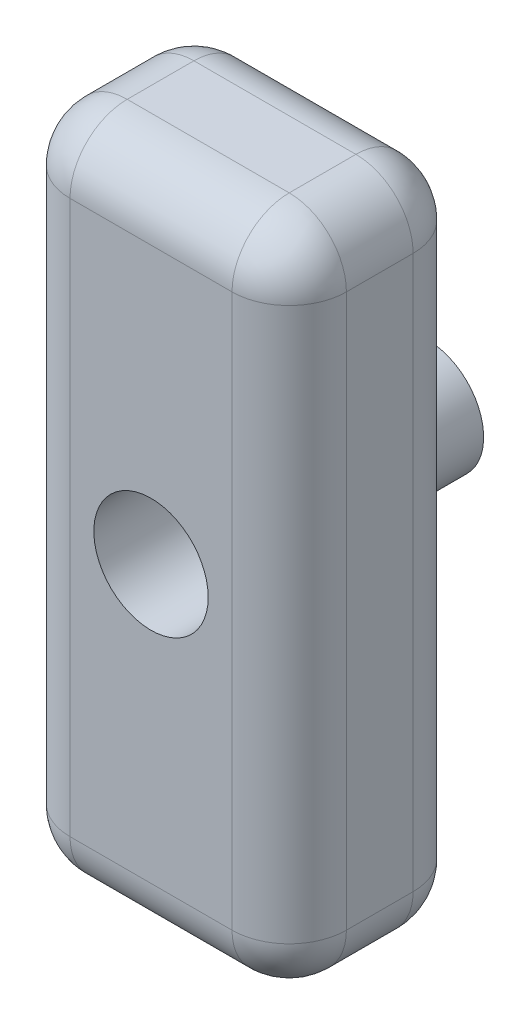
ISO-10303-21;
HEADER;
FILE_DESCRIPTION(('STEP AP214'),'2;1');
FILE_NAME('part.step','',(''),(''),'','','');
FILE_SCHEMA(('AUTOMOTIVE_DESIGN { 1 0 10303 214 1 1 1 1 }'));
ENDSEC;
DATA;
#1=APPLICATION_CONTEXT('core data for automotive mechanical design processes');
#2=APPLICATION_PROTOCOL_DEFINITION('international standard','automotive_design',2000,#1);
#3=PRODUCT_CONTEXT('',#1,'mechanical');
#4=PRODUCT('Part','Part','',(#3));
#5=PRODUCT_RELATED_PRODUCT_CATEGORY('part','',(#4));
#6=PRODUCT_DEFINITION_FORMATION('','',#4);
#7=PRODUCT_DEFINITION_CONTEXT('part definition',#1,'design');
#8=PRODUCT_DEFINITION('design','',#6,#7);
#9=PRODUCT_DEFINITION_SHAPE('','',#8);
#10=(LENGTH_UNIT() NAMED_UNIT(*) SI_UNIT(.MILLI.,.METRE.));
#11=(NAMED_UNIT(*) PLANE_ANGLE_UNIT() SI_UNIT($,.RADIAN.));
#12=(NAMED_UNIT(*) SI_UNIT($,.STERADIAN.) SOLID_ANGLE_UNIT());
#13=UNCERTAINTY_MEASURE_WITH_UNIT(LENGTH_MEASURE(1.E-05),#10,'distance_accuracy_value','');
#14=(GEOMETRIC_REPRESENTATION_CONTEXT(3) GLOBAL_UNCERTAINTY_ASSIGNED_CONTEXT((#13)) GLOBAL_UNIT_ASSIGNED_CONTEXT((#10,
#11,#12)) REPRESENTATION_CONTEXT('',''));
#15=CARTESIAN_POINT('',(0.,0.,0.));
#16=DIRECTION('',(0.,0.,1.));
#17=DIRECTION('',(1.,0.,0.));
#18=AXIS2_PLACEMENT_3D('',#15,#16,#17);
#19=CARTESIAN_POINT('',(24.5,-15.5,19.));
#20=DIRECTION('',(0.,1.,0.));
#21=DIRECTION('',(0.,0.,1.));
#22=AXIS2_PLACEMENT_3D('',#19,#20,#21);
#23=PLANE('',#22);
#24=DIRECTION('',(0.,0.,-1.));
#25=VECTOR('',#24,1.);
#26=CARTESIAN_POINT('',(18.5,-15.5,19.));
#27=LINE('',#26,#25);
#28=CARTESIAN_POINT('',(18.5,-15.5,6.));
#29=VERTEX_POINT('',#28);
#30=CARTESIAN_POINT('',(18.5,-15.5,13.));
#31=VERTEX_POINT('',#30);
#32=EDGE_CURVE('E55',#29,#31,#27,.F.);
#33=ORIENTED_EDGE('',*,*,#32,.T.);
#34=DIRECTION('',(1.,0.,0.));
#35=VECTOR('',#34,1.);
#36=CARTESIAN_POINT('',(-4.49999999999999,-15.5,13.));
#37=LINE('',#36,#35);
#38=CARTESIAN_POINT('',(1.50000000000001,-15.5,13.));
#39=VERTEX_POINT('',#38);
#40=EDGE_CURVE('E11',#31,#39,#37,.F.);
#41=ORIENTED_EDGE('',*,*,#40,.T.);
#42=DIRECTION('',(0.,0.,-1.));
#43=VECTOR('',#42,1.);
#44=CARTESIAN_POINT('',(1.50000000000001,-15.5,19.));
#45=LINE('',#44,#43);
#46=CARTESIAN_POINT('',(1.50000000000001,-15.5,6.));
#47=VERTEX_POINT('',#46);
#48=EDGE_CURVE('E44',#39,#47,#45,.T.);
#49=ORIENTED_EDGE('',*,*,#48,.T.);
#50=DIRECTION('',(1.,0.,0.));
#51=VECTOR('',#50,1.);
#52=CARTESIAN_POINT('',(24.5,-15.5,6.));
#53=LINE('',#52,#51);
#54=EDGE_CURVE('E202',#47,#29,#53,.T.);
#55=ORIENTED_EDGE('',*,*,#54,.T.);
#56=EDGE_LOOP('',(#33,#41,#49,#55));
#57=FACE_BOUND('',#56,.T.);
#58=ADVANCED_FACE('F35',(#57),#23,.F.);
#59=CARTESIAN_POINT('',(24.5,54.5,19.));
#60=DIRECTION('',(-1.,0.,0.));
#61=DIRECTION('',(0.,-1.,0.));
#62=AXIS2_PLACEMENT_3D('',#59,#60,#61);
#63=PLANE('',#62);
#64=DIRECTION('',(0.,0.,-1.));
#65=VECTOR('',#64,1.);
#66=CARTESIAN_POINT('',(24.5,-9.49999999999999,19.));
#67=LINE('',#66,#65);
#68=CARTESIAN_POINT('',(24.5,-9.49999999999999,13.));
#69=VERTEX_POINT('',#68);
#70=CARTESIAN_POINT('',(24.5,-9.49999999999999,6.));
#71=VERTEX_POINT('',#70);
#72=EDGE_CURVE('E195',#69,#71,#67,.T.);
#73=ORIENTED_EDGE('',*,*,#72,.T.);
#74=DIRECTION('',(0.,1.,0.));
#75=VECTOR('',#74,1.);
#76=CARTESIAN_POINT('',(24.5,54.5,6.));
#77=LINE('',#76,#75);
#78=CARTESIAN_POINT('',(24.5,48.5,6.));
#79=VERTEX_POINT('',#78);
#80=EDGE_CURVE('E200',#71,#79,#77,.T.);
#81=ORIENTED_EDGE('',*,*,#80,.T.);
#82=DIRECTION('',(0.,0.,-1.));
#83=VECTOR('',#82,1.);
#84=CARTESIAN_POINT('',(24.5,48.5,19.));
#85=LINE('',#84,#83);
#86=CARTESIAN_POINT('',(24.5,48.5,13.));
#87=VERTEX_POINT('',#86);
#88=EDGE_CURVE('E197',#79,#87,#85,.F.);
#89=ORIENTED_EDGE('',*,*,#88,.T.);
#90=DIRECTION('',(0.,1.,0.));
#91=VECTOR('',#90,1.);
#92=CARTESIAN_POINT('',(24.5,-15.5,13.));
#93=LINE('',#92,#91);
#94=EDGE_CURVE('E193',#87,#69,#93,.F.);
#95=ORIENTED_EDGE('',*,*,#94,.T.);
#96=EDGE_LOOP('',(#73,#81,#89,#95));
#97=FACE_BOUND('',#96,.T.);
#98=ADVANCED_FACE('F300',(#97),#63,.F.);
#99=CARTESIAN_POINT('',(10.,54.5,19.));
#100=DIRECTION('',(0.,-1.,0.));
#101=DIRECTION('',(0.,0.,-1.));
#102=AXIS2_PLACEMENT_3D('',#99,#100,#101);
#103=PLANE('',#102);
#104=DIRECTION('',(-1.,0.,0.));
#105=VECTOR('',#104,1.);
#106=CARTESIAN_POINT('',(10.,54.5,6.));
#107=LINE('',#106,#105);
#108=CARTESIAN_POINT('',(18.5,54.5,6.));
#109=VERTEX_POINT('',#108);
#110=CARTESIAN_POINT('',(1.5,54.5,6.));
#111=VERTEX_POINT('',#110);
#112=EDGE_CURVE('E168',#109,#111,#107,.T.);
#113=ORIENTED_EDGE('',*,*,#112,.T.);
#114=DIRECTION('',(0.,0.,-1.));
#115=VECTOR('',#114,1.);
#116=CARTESIAN_POINT('',(1.5,54.5,19.));
#117=LINE('',#116,#115);
#118=CARTESIAN_POINT('',(1.5,54.5,13.));
#119=VERTEX_POINT('',#118);
#120=EDGE_CURVE('E173',#111,#119,#117,.F.);
#121=ORIENTED_EDGE('',*,*,#120,.T.);
#122=DIRECTION('',(-1.,0.,0.));
#123=VECTOR('',#122,1.);
#124=CARTESIAN_POINT('',(24.5,54.5,13.));
#125=LINE('',#124,#123);
#126=CARTESIAN_POINT('',(18.5,54.5,13.));
#127=VERTEX_POINT('',#126);
#128=EDGE_CURVE('E170',#119,#127,#125,.F.);
#129=ORIENTED_EDGE('',*,*,#128,.T.);
#130=DIRECTION('',(0.,0.,-1.));
#131=VECTOR('',#130,1.);
#132=CARTESIAN_POINT('',(18.5,54.5,19.));
#133=LINE('',#132,#131);
#134=EDGE_CURVE('E166',#127,#109,#133,.T.);
#135=ORIENTED_EDGE('',*,*,#134,.T.);
#136=EDGE_LOOP('',(#113,#121,#129,#135));
#137=FACE_BOUND('',#136,.T.);
#138=ADVANCED_FACE('F295',(#137),#103,.F.);
#139=CARTESIAN_POINT('',(-4.5,54.5,19.));
#140=DIRECTION('',(1.,0.,0.));
#141=DIRECTION('',(0.,1.,0.));
#142=AXIS2_PLACEMENT_3D('',#139,#140,#141);
#143=PLANE('',#142);
#144=DIRECTION('',(0.,0.,-1.));
#145=VECTOR('',#144,1.);
#146=CARTESIAN_POINT('',(-4.5,48.5,19.));
#147=LINE('',#146,#145);
#148=CARTESIAN_POINT('',(-4.5,48.5,13.));
#149=VERTEX_POINT('',#148);
#150=CARTESIAN_POINT('',(-4.5,48.5,6.));
#151=VERTEX_POINT('',#150);
#152=EDGE_CURVE('E188',#149,#151,#147,.T.);
#153=ORIENTED_EDGE('',*,*,#152,.T.);
#154=DIRECTION('',(0.,-1.,0.));
#155=VECTOR('',#154,1.);
#156=CARTESIAN_POINT('',(-4.5,54.5,6.));
#157=LINE('',#156,#155);
#158=CARTESIAN_POINT('',(-4.49999999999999,-9.5,6.));
#159=VERTEX_POINT('',#158);
#160=EDGE_CURVE('E191',#151,#159,#157,.T.);
#161=ORIENTED_EDGE('',*,*,#160,.T.);
#162=DIRECTION('',(0.,0.,-1.));
#163=VECTOR('',#162,1.);
#164=CARTESIAN_POINT('',(-4.49999999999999,-9.49999999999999,19.));
#165=LINE('',#164,#163);
#166=CARTESIAN_POINT('',(-4.49999999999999,-9.5,13.));
#167=VERTEX_POINT('',#166);
#168=EDGE_CURVE('E186',#159,#167,#165,.F.);
#169=ORIENTED_EDGE('',*,*,#168,.T.);
#170=DIRECTION('',(0.,-1.,0.));
#171=VECTOR('',#170,1.);
#172=CARTESIAN_POINT('',(-4.5,54.5,13.));
#173=LINE('',#172,#171);
#174=EDGE_CURVE('E184',#167,#149,#173,.F.);
#175=ORIENTED_EDGE('',*,*,#174,.T.);
#176=EDGE_LOOP('',(#153,#161,#169,#175));
#177=FACE_BOUND('',#176,.T.);
#178=ADVANCED_FACE('F286',(#177),#143,.F.);
#179=CARTESIAN_POINT('',(0.,0.,19.));
#180=DIRECTION('',(0.,0.,1.));
#181=DIRECTION('',(1.,0.,0.));
#182=AXIS2_PLACEMENT_3D('',#179,#180,#181);
#183=PLANE('',#182);
#184=CARTESIAN_POINT('',(10.,19.5,19.));
#185=DIRECTION('',(0.,0.,1.));
#186=DIRECTION('',(1.,0.,0.));
#187=AXIS2_PLACEMENT_3D('',#184,#185,#186);
#188=CIRCLE('',#187,6.);
#189=CARTESIAN_POINT('',(16.,19.5,19.));
#190=VERTEX_POINT('',#189);
#191=EDGE_CURVE('E269',#190,#190,#188,.T.);
#192=ORIENTED_EDGE('',*,*,#191,.F.);
#193=EDGE_LOOP('',(#192));
#194=FACE_BOUND('',#193,.T.);
#195=DIRECTION('',(-1.,0.,0.));
#196=VECTOR('',#195,1.);
#197=CARTESIAN_POINT('',(-4.5,48.5,19.));
#198=LINE('',#197,#196);
#199=CARTESIAN_POINT('',(18.5,48.5,19.));
#200=VERTEX_POINT('',#199);
#201=CARTESIAN_POINT('',(1.5,48.5,19.));
#202=VERTEX_POINT('',#201);
#203=EDGE_CURVE('E134',#200,#202,#198,.T.);
#204=ORIENTED_EDGE('',*,*,#203,.T.);
#205=DIRECTION('',(0.,-1.,0.));
#206=VECTOR('',#205,1.);
#207=CARTESIAN_POINT('',(1.50000000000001,-15.5,19.));
#208=LINE('',#207,#206);
#209=CARTESIAN_POINT('',(1.50000000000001,-9.5,19.));
#210=VERTEX_POINT('',#209);
#211=EDGE_CURVE('E130',#202,#210,#208,.T.);
#212=ORIENTED_EDGE('',*,*,#211,.T.);
#213=DIRECTION('',(1.,0.,0.));
#214=VECTOR('',#213,1.);
#215=CARTESIAN_POINT('',(24.5,-9.5,19.));
#216=LINE('',#215,#214);
#217=CARTESIAN_POINT('',(18.5,-9.5,19.));
#218=VERTEX_POINT('',#217);
#219=EDGE_CURVE('E122',#210,#218,#216,.T.);
#220=ORIENTED_EDGE('',*,*,#219,.T.);
#221=DIRECTION('',(0.,1.,0.));
#222=VECTOR('',#221,1.);
#223=CARTESIAN_POINT('',(18.5,54.5,19.));
#224=LINE('',#223,#222);
#225=EDGE_CURVE('E127',#218,#200,#224,.T.);
#226=ORIENTED_EDGE('',*,*,#225,.T.);
#227=EDGE_LOOP('',(#204,#212,#220,#226));
#228=FACE_BOUND('',#227,.T.);
#229=ADVANCED_FACE('F125',(#194,#228),#183,.T.);
#230=CARTESIAN_POINT('',(0.,0.,0.));
#231=DIRECTION('',(0.,0.,1.));
#232=DIRECTION('',(1.,0.,0.));
#233=AXIS2_PLACEMENT_3D('',#230,#231,#232);
#234=PLANE('',#233);
#235=DIRECTION('',(1.,0.,0.));
#236=VECTOR('',#235,1.);
#237=CARTESIAN_POINT('',(0.,-9.5,0.));
#238=LINE('',#237,#236);
#239=CARTESIAN_POINT('',(18.5,-9.5,0.));
#240=VERTEX_POINT('',#239);
#241=CARTESIAN_POINT('',(1.50000000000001,-9.5,0.));
#242=VERTEX_POINT('',#241);
#243=EDGE_CURVE('E177',#240,#242,#238,.F.);
#244=ORIENTED_EDGE('',*,*,#243,.T.);
#245=DIRECTION('',(0.,-1.,0.));
#246=VECTOR('',#245,1.);
#247=CARTESIAN_POINT('',(1.50000000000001,0.,0.));
#248=LINE('',#247,#246);
#249=CARTESIAN_POINT('',(1.5,48.5,0.));
#250=VERTEX_POINT('',#249);
#251=EDGE_CURVE('E182',#242,#250,#248,.F.);
#252=ORIENTED_EDGE('',*,*,#251,.T.);
#253=DIRECTION('',(-1.,0.,0.));
#254=VECTOR('',#253,1.);
#255=CARTESIAN_POINT('',(0.,48.5,0.));
#256=LINE('',#255,#254);
#257=CARTESIAN_POINT('',(18.5,48.5,0.));
#258=VERTEX_POINT('',#257);
#259=EDGE_CURVE('E179',#250,#258,#256,.F.);
#260=ORIENTED_EDGE('',*,*,#259,.T.);
#261=DIRECTION('',(0.,1.,0.));
#262=VECTOR('',#261,1.);
#263=CARTESIAN_POINT('',(18.5,0.,0.));
#264=LINE('',#263,#262);
#265=EDGE_CURVE('E175',#258,#240,#264,.F.);
#266=ORIENTED_EDGE('',*,*,#265,.T.);
#267=EDGE_LOOP('',(#244,#252,#260,#266));
#268=FACE_BOUND('',#267,.T.);
#269=CARTESIAN_POINT('',(10.,19.5,0.));
#270=DIRECTION('',(0.,0.,-1.));
#271=DIRECTION('',(-1.,0.,0.));
#272=AXIS2_PLACEMENT_3D('',#269,#270,#271);
#273=CIRCLE('',#272,5.9);
#274=CARTESIAN_POINT('',(4.1,19.5,0.));
#275=VERTEX_POINT('',#274);
#276=EDGE_CURVE('E157',#275,#275,#273,.T.);
#277=ORIENTED_EDGE('',*,*,#276,.F.);
#278=EDGE_LOOP('',(#277));
#279=FACE_BOUND('',#278,.T.);
#280=ADVANCED_FACE('F285',(#268,#279),#234,.F.);
#281=CARTESIAN_POINT('',(10.,19.5,-10.));
#282=DIRECTION('',(0.,0.,1.));
#283=DIRECTION('',(1.,0.,0.));
#284=AXIS2_PLACEMENT_3D('',#281,#282,#283);
#285=CYLINDRICAL_SURFACE('',#284,5.9);
#286=CARTESIAN_POINT('',(10.,19.5,-10.));
#287=DIRECTION('',(0.,0.,-1.));
#288=DIRECTION('',(-1.,0.,0.));
#289=AXIS2_PLACEMENT_3D('',#286,#287,#288);
#290=CIRCLE('',#289,5.9);
#291=CARTESIAN_POINT('',(4.1,19.5,-10.));
#292=VERTEX_POINT('',#291);
#293=EDGE_CURVE('E160',#292,#292,#290,.T.);
#294=ORIENTED_EDGE('',*,*,#293,.F.);
#295=EDGE_LOOP('',(#294));
#296=FACE_BOUND('',#295,.T.);
#297=ORIENTED_EDGE('',*,*,#276,.T.);
#298=EDGE_LOOP('',(#297));
#299=FACE_BOUND('',#298,.T.);
#300=ADVANCED_FACE('F292',(#296,#299),#285,.T.);
#301=CARTESIAN_POINT('',(10.,19.5,-10.));
#302=DIRECTION('',(0.,0.,-1.));
#303=DIRECTION('',(-1.,0.,0.));
#304=AXIS2_PLACEMENT_3D('',#301,#302,#303);
#305=PLANE('',#304);
#306=ORIENTED_EDGE('',*,*,#293,.T.);
#307=EDGE_LOOP('',(#306));
#308=FACE_BOUND('',#307,.T.);
#309=ADVANCED_FACE('F377',(#308),#305,.T.);
#310=CARTESIAN_POINT('',(24.5,-9.5,6.));
#311=DIRECTION('',(1.,0.,0.));
#312=DIRECTION('',(0.,0.,-1.));
#313=AXIS2_PLACEMENT_3D('',#310,#311,#312);
#314=CYLINDRICAL_SURFACE('',#313,6.);
#315=CARTESIAN_POINT('',(18.5,-9.5,6.));
#316=DIRECTION('',(1.,0.,0.));
#317=DIRECTION('',(0.,0.,-1.));
#318=AXIS2_PLACEMENT_3D('',#315,#316,#317);
#319=CIRCLE('',#318,6.);
#320=EDGE_CURVE('E39',#29,#240,#319,.T.);
#321=ORIENTED_EDGE('',*,*,#320,.F.);
#322=ORIENTED_EDGE('',*,*,#54,.F.);
#323=CARTESIAN_POINT('',(1.50000000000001,-9.5,6.));
#324=DIRECTION('',(-1.,0.,0.));
#325=DIRECTION('',(0.,-1.,0.));
#326=AXIS2_PLACEMENT_3D('',#323,#324,#325);
#327=CIRCLE('',#326,6.);
#328=EDGE_CURVE('E253',#242,#47,#327,.T.);
#329=ORIENTED_EDGE('',*,*,#328,.F.);
#330=ORIENTED_EDGE('',*,*,#243,.F.);
#331=EDGE_LOOP('',(#321,#322,#329,#330));
#332=FACE_BOUND('',#331,.T.);
#333=ADVANCED_FACE('F37',(#332),#314,.T.);
#334=CARTESIAN_POINT('',(18.5,-9.5,6.));
#335=DIRECTION('',(0.,0.,1.));
#336=DIRECTION('',(1.,0.,0.));
#337=AXIS2_PLACEMENT_3D('',#334,#335,#336);
#338=SPHERICAL_SURFACE('',#337,6.);
#339=CARTESIAN_POINT('',(18.5,-9.49999999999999,6.));
#340=DIRECTION('',(0.,0.,-1.));
#341=DIRECTION('',(-1.,0.,0.));
#342=AXIS2_PLACEMENT_3D('',#339,#340,#341);
#343=CIRCLE('',#342,6.);
#344=EDGE_CURVE('E248',#29,#71,#343,.F.);
#345=ORIENTED_EDGE('',*,*,#344,.F.);
#346=ORIENTED_EDGE('',*,*,#320,.T.);
#347=CARTESIAN_POINT('',(18.5,-9.5,6.));
#348=DIRECTION('',(0.,-1.,0.));
#349=DIRECTION('',(1.,0.,0.));
#350=AXIS2_PLACEMENT_3D('',#347,#348,#349);
#351=CIRCLE('',#350,6.);
#352=EDGE_CURVE('E251',#71,#240,#351,.F.);
#353=ORIENTED_EDGE('',*,*,#352,.F.);
#354=EDGE_LOOP('',(#345,#346,#353));
#355=FACE_BOUND('',#354,.T.);
#356=ADVANCED_FACE('F372',(#355),#338,.T.);
#357=CARTESIAN_POINT('',(1.50000000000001,-9.5,6.));
#358=DIRECTION('',(0.,0.,1.));
#359=DIRECTION('',(1.,0.,0.));
#360=AXIS2_PLACEMENT_3D('',#357,#358,#359);
#361=SPHERICAL_SURFACE('',#360,6.);
#362=CARTESIAN_POINT('',(1.50000000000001,-9.5,6.));
#363=DIRECTION('',(0.,-1.,0.));
#364=DIRECTION('',(0.,0.,-1.));
#365=AXIS2_PLACEMENT_3D('',#362,#363,#364);
#366=CIRCLE('',#365,6.);
#367=EDGE_CURVE('E243',#242,#159,#366,.F.);
#368=ORIENTED_EDGE('',*,*,#367,.F.);
#369=ORIENTED_EDGE('',*,*,#328,.T.);
#370=CARTESIAN_POINT('',(1.50000000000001,-9.5,6.));
#371=DIRECTION('',(0.,0.,-1.));
#372=DIRECTION('',(-1.,0.,0.));
#373=AXIS2_PLACEMENT_3D('',#370,#371,#372);
#374=CIRCLE('',#373,6.);
#375=EDGE_CURVE('E246',#159,#47,#374,.F.);
#376=ORIENTED_EDGE('',*,*,#375,.F.);
#377=EDGE_LOOP('',(#368,#369,#376));
#378=FACE_BOUND('',#377,.T.);
#379=ADVANCED_FACE('F369',(#378),#361,.T.);
#380=CARTESIAN_POINT('',(18.5,54.5,6.));
#381=DIRECTION('',(0.,1.,0.));
#382=DIRECTION('',(-1.,0.,0.));
#383=AXIS2_PLACEMENT_3D('',#380,#381,#382);
#384=CYLINDRICAL_SURFACE('',#383,6.);
#385=ORIENTED_EDGE('',*,*,#352,.T.);
#386=ORIENTED_EDGE('',*,*,#265,.F.);
#387=CARTESIAN_POINT('',(18.5,48.5,6.));
#388=DIRECTION('',(0.,1.,0.));
#389=DIRECTION('',(0.,0.,1.));
#390=AXIS2_PLACEMENT_3D('',#387,#388,#389);
#391=CIRCLE('',#390,6.);
#392=EDGE_CURVE('E238',#79,#258,#391,.T.);
#393=ORIENTED_EDGE('',*,*,#392,.F.);
#394=ORIENTED_EDGE('',*,*,#80,.F.);
#395=EDGE_LOOP('',(#385,#386,#393,#394));
#396=FACE_BOUND('',#395,.T.);
#397=ADVANCED_FACE('F365',(#396),#384,.T.);
#398=CARTESIAN_POINT('',(18.5,-9.49999999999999,19.));
#399=DIRECTION('',(0.,0.,-1.));
#400=DIRECTION('',(-1.,0.,0.));
#401=AXIS2_PLACEMENT_3D('',#398,#399,#400);
#402=CYLINDRICAL_SURFACE('',#401,6.);
#403=ORIENTED_EDGE('',*,*,#344,.T.);
#404=ORIENTED_EDGE('',*,*,#72,.F.);
#405=CARTESIAN_POINT('',(18.5,-9.5,13.));
#406=DIRECTION('',(0.,0.,1.));
#407=DIRECTION('',(1.,0.,0.));
#408=AXIS2_PLACEMENT_3D('',#405,#406,#407);
#409=CIRCLE('',#408,6.);
#410=EDGE_CURVE('E143',#31,#69,#409,.T.);
#411=ORIENTED_EDGE('',*,*,#410,.F.);
#412=ORIENTED_EDGE('',*,*,#32,.F.);
#413=EDGE_LOOP('',(#403,#404,#411,#412));
#414=FACE_BOUND('',#413,.T.);
#415=ADVANCED_FACE('F362',(#414),#402,.T.);
#416=CARTESIAN_POINT('',(0.,-9.5,13.));
#417=DIRECTION('',(-1.,0.,0.));
#418=DIRECTION('',(0.,0.,1.));
#419=AXIS2_PLACEMENT_3D('',#416,#417,#418);
#420=CYLINDRICAL_SURFACE('',#419,6.);
#421=CARTESIAN_POINT('',(1.50000000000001,-9.5,13.));
#422=DIRECTION('',(-1.,0.,0.));
#423=DIRECTION('',(0.,0.,1.));
#424=AXIS2_PLACEMENT_3D('',#421,#422,#423);
#425=CIRCLE('',#424,6.);
#426=EDGE_CURVE('E144',#39,#210,#425,.T.);
#427=ORIENTED_EDGE('',*,*,#426,.F.);
#428=ORIENTED_EDGE('',*,*,#40,.F.);
#429=CARTESIAN_POINT('',(18.5,-9.5,13.));
#430=DIRECTION('',(1.,0.,0.));
#431=DIRECTION('',(0.,0.,-1.));
#432=AXIS2_PLACEMENT_3D('',#429,#430,#431);
#433=CIRCLE('',#432,6.);
#434=EDGE_CURVE('E137',#218,#31,#433,.T.);
#435=ORIENTED_EDGE('',*,*,#434,.F.);
#436=ORIENTED_EDGE('',*,*,#219,.F.);
#437=EDGE_LOOP('',(#427,#428,#435,#436));
#438=FACE_BOUND('',#437,.T.);
#439=ADVANCED_FACE('F139',(#438),#420,.T.);
#440=CARTESIAN_POINT('',(1.50000000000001,-9.5,19.));
#441=DIRECTION('',(0.,0.,-1.));
#442=DIRECTION('',(-1.,0.,0.));
#443=AXIS2_PLACEMENT_3D('',#440,#441,#442);
#444=CYLINDRICAL_SURFACE('',#443,6.);
#445=ORIENTED_EDGE('',*,*,#375,.T.);
#446=ORIENTED_EDGE('',*,*,#48,.F.);
#447=CARTESIAN_POINT('',(1.50000000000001,-9.5,13.));
#448=DIRECTION('',(0.,0.,1.));
#449=DIRECTION('',(1.,0.,0.));
#450=AXIS2_PLACEMENT_3D('',#447,#448,#449);
#451=CIRCLE('',#450,6.);
#452=EDGE_CURVE('E233',#167,#39,#451,.T.);
#453=ORIENTED_EDGE('',*,*,#452,.F.);
#454=ORIENTED_EDGE('',*,*,#168,.F.);
#455=EDGE_LOOP('',(#445,#446,#453,#454));
#456=FACE_BOUND('',#455,.T.);
#457=ADVANCED_FACE('F355',(#456),#444,.T.);
#458=CARTESIAN_POINT('',(1.5,54.5,6.));
#459=DIRECTION('',(0.,-1.,0.));
#460=DIRECTION('',(1.,0.,0.));
#461=AXIS2_PLACEMENT_3D('',#458,#459,#460);
#462=CYLINDRICAL_SURFACE('',#461,6.);
#463=ORIENTED_EDGE('',*,*,#367,.T.);
#464=ORIENTED_EDGE('',*,*,#160,.F.);
#465=CARTESIAN_POINT('',(1.5,48.5,6.));
#466=DIRECTION('',(0.,1.,0.));
#467=DIRECTION('',(0.,0.,1.));
#468=AXIS2_PLACEMENT_3D('',#465,#466,#467);
#469=CIRCLE('',#468,6.);
#470=EDGE_CURVE('E230',#250,#151,#469,.T.);
#471=ORIENTED_EDGE('',*,*,#470,.F.);
#472=ORIENTED_EDGE('',*,*,#251,.F.);
#473=EDGE_LOOP('',(#463,#464,#471,#472));
#474=FACE_BOUND('',#473,.T.);
#475=ADVANCED_FACE('F351',(#474),#462,.T.);
#476=CARTESIAN_POINT('',(10.,48.5,6.));
#477=DIRECTION('',(-1.,0.,0.));
#478=DIRECTION('',(0.,0.,1.));
#479=AXIS2_PLACEMENT_3D('',#476,#477,#478);
#480=CYLINDRICAL_SURFACE('',#479,6.);
#481=CARTESIAN_POINT('',(18.5,48.5,6.));
#482=DIRECTION('',(1.,0.,0.));
#483=DIRECTION('',(0.,0.,-1.));
#484=AXIS2_PLACEMENT_3D('',#481,#482,#483);
#485=CIRCLE('',#484,6.);
#486=EDGE_CURVE('E240',#258,#109,#485,.T.);
#487=ORIENTED_EDGE('',*,*,#486,.F.);
#488=ORIENTED_EDGE('',*,*,#259,.F.);
#489=CARTESIAN_POINT('',(1.5,48.5,6.));
#490=DIRECTION('',(-1.,0.,0.));
#491=DIRECTION('',(0.,0.,1.));
#492=AXIS2_PLACEMENT_3D('',#489,#490,#491);
#493=CIRCLE('',#492,6.);
#494=EDGE_CURVE('E227',#111,#250,#493,.T.);
#495=ORIENTED_EDGE('',*,*,#494,.F.);
#496=ORIENTED_EDGE('',*,*,#112,.F.);
#497=EDGE_LOOP('',(#487,#488,#495,#496));
#498=FACE_BOUND('',#497,.T.);
#499=ADVANCED_FACE('F347',(#498),#480,.T.);
#500=CARTESIAN_POINT('',(18.5,48.5,6.));
#501=DIRECTION('',(0.,0.,1.));
#502=DIRECTION('',(1.,0.,0.));
#503=AXIS2_PLACEMENT_3D('',#500,#501,#502);
#504=SPHERICAL_SURFACE('',#503,6.);
#505=ORIENTED_EDGE('',*,*,#392,.T.);
#506=ORIENTED_EDGE('',*,*,#486,.T.);
#507=CARTESIAN_POINT('',(18.5,48.5,6.));
#508=DIRECTION('',(0.,0.,-1.));
#509=DIRECTION('',(-1.,0.,0.));
#510=AXIS2_PLACEMENT_3D('',#507,#508,#509);
#511=CIRCLE('',#510,6.);
#512=EDGE_CURVE('E151',#79,#109,#511,.F.);
#513=ORIENTED_EDGE('',*,*,#512,.F.);
#514=EDGE_LOOP('',(#505,#506,#513));
#515=FACE_BOUND('',#514,.T.);
#516=ADVANCED_FACE('F344',(#515),#504,.T.);
#517=CARTESIAN_POINT('',(18.5,-9.5,13.));
#518=DIRECTION('',(0.,0.,1.));
#519=DIRECTION('',(1.,0.,0.));
#520=AXIS2_PLACEMENT_3D('',#517,#518,#519);
#521=SPHERICAL_SURFACE('',#520,6.);
#522=ORIENTED_EDGE('',*,*,#434,.T.);
#523=ORIENTED_EDGE('',*,*,#410,.T.);
#524=CARTESIAN_POINT('',(18.5,-9.49999999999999,13.));
#525=DIRECTION('',(0.,-1.,0.));
#526=DIRECTION('',(0.,0.,-1.));
#527=AXIS2_PLACEMENT_3D('',#524,#525,#526);
#528=CIRCLE('',#527,6.);
#529=EDGE_CURVE('E147',#218,#69,#528,.F.);
#530=ORIENTED_EDGE('',*,*,#529,.F.);
#531=EDGE_LOOP('',(#522,#523,#530));
#532=FACE_BOUND('',#531,.T.);
#533=ADVANCED_FACE('F148',(#532),#521,.T.);
#534=CARTESIAN_POINT('',(1.50000000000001,-9.5,13.));
#535=DIRECTION('',(0.,0.,1.));
#536=DIRECTION('',(1.,0.,0.));
#537=AXIS2_PLACEMENT_3D('',#534,#535,#536);
#538=SPHERICAL_SURFACE('',#537,6.);
#539=ORIENTED_EDGE('',*,*,#452,.T.);
#540=ORIENTED_EDGE('',*,*,#426,.T.);
#541=CARTESIAN_POINT('',(1.50000000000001,-9.5,13.));
#542=DIRECTION('',(0.,-1.,0.));
#543=DIRECTION('',(0.,0.,-1.));
#544=AXIS2_PLACEMENT_3D('',#541,#542,#543);
#545=CIRCLE('',#544,6.);
#546=EDGE_CURVE('E152',#167,#210,#545,.F.);
#547=ORIENTED_EDGE('',*,*,#546,.F.);
#548=EDGE_LOOP('',(#539,#540,#547));
#549=FACE_BOUND('',#548,.T.);
#550=ADVANCED_FACE('F337',(#549),#538,.T.);
#551=CARTESIAN_POINT('',(1.5,48.5,6.));
#552=DIRECTION('',(0.,0.,1.));
#553=DIRECTION('',(1.,0.,0.));
#554=AXIS2_PLACEMENT_3D('',#551,#552,#553);
#555=SPHERICAL_SURFACE('',#554,6.);
#556=ORIENTED_EDGE('',*,*,#494,.T.);
#557=ORIENTED_EDGE('',*,*,#470,.T.);
#558=CARTESIAN_POINT('',(1.5,48.5,6.));
#559=DIRECTION('',(0.,0.,-1.));
#560=DIRECTION('',(-1.,0.,0.));
#561=AXIS2_PLACEMENT_3D('',#558,#559,#560);
#562=CIRCLE('',#561,6.);
#563=EDGE_CURVE('E221',#111,#151,#562,.F.);
#564=ORIENTED_EDGE('',*,*,#563,.F.);
#565=EDGE_LOOP('',(#556,#557,#564));
#566=FACE_BOUND('',#565,.T.);
#567=ADVANCED_FACE('F333',(#566),#555,.T.);
#568=CARTESIAN_POINT('',(18.5,48.5,19.));
#569=DIRECTION('',(0.,0.,-1.));
#570=DIRECTION('',(-1.,0.,0.));
#571=AXIS2_PLACEMENT_3D('',#568,#569,#570);
#572=CYLINDRICAL_SURFACE('',#571,6.);
#573=ORIENTED_EDGE('',*,*,#512,.T.);
#574=ORIENTED_EDGE('',*,*,#134,.F.);
#575=CARTESIAN_POINT('',(18.5,48.5,13.));
#576=DIRECTION('',(0.,0.,1.));
#577=DIRECTION('',(1.,0.,0.));
#578=AXIS2_PLACEMENT_3D('',#575,#576,#577);
#579=CIRCLE('',#578,6.);
#580=EDGE_CURVE('E218',#87,#127,#579,.T.);
#581=ORIENTED_EDGE('',*,*,#580,.F.);
#582=ORIENTED_EDGE('',*,*,#88,.F.);
#583=EDGE_LOOP('',(#573,#574,#581,#582));
#584=FACE_BOUND('',#583,.T.);
#585=ADVANCED_FACE('F330',(#584),#572,.T.);
#586=CARTESIAN_POINT('',(18.5,0.,13.));
#587=DIRECTION('',(0.,-1.,0.));
#588=DIRECTION('',(1.,0.,0.));
#589=AXIS2_PLACEMENT_3D('',#586,#587,#588);
#590=CYLINDRICAL_SURFACE('',#589,6.);
#591=ORIENTED_EDGE('',*,*,#529,.T.);
#592=ORIENTED_EDGE('',*,*,#94,.F.);
#593=CARTESIAN_POINT('',(18.5,48.5,13.));
#594=DIRECTION('',(0.,1.,0.));
#595=DIRECTION('',(0.,0.,1.));
#596=AXIS2_PLACEMENT_3D('',#593,#594,#595);
#597=CIRCLE('',#596,6.);
#598=EDGE_CURVE('E155',#200,#87,#597,.T.);
#599=ORIENTED_EDGE('',*,*,#598,.F.);
#600=ORIENTED_EDGE('',*,*,#225,.F.);
#601=EDGE_LOOP('',(#591,#592,#599,#600));
#602=FACE_BOUND('',#601,.T.);
#603=ADVANCED_FACE('F154',(#602),#590,.T.);
#604=CARTESIAN_POINT('',(1.50000000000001,0.,13.));
#605=DIRECTION('',(0.,1.,0.));
#606=DIRECTION('',(-1.,0.,0.));
#607=AXIS2_PLACEMENT_3D('',#604,#605,#606);
#608=CYLINDRICAL_SURFACE('',#607,6.);
#609=ORIENTED_EDGE('',*,*,#546,.T.);
#610=ORIENTED_EDGE('',*,*,#211,.F.);
#611=CARTESIAN_POINT('',(1.5,48.5,13.));
#612=DIRECTION('',(0.,1.,0.));
#613=DIRECTION('',(0.,0.,1.));
#614=AXIS2_PLACEMENT_3D('',#611,#612,#613);
#615=CIRCLE('',#614,6.);
#616=EDGE_CURVE('E214',#149,#202,#615,.T.);
#617=ORIENTED_EDGE('',*,*,#616,.F.);
#618=ORIENTED_EDGE('',*,*,#174,.F.);
#619=EDGE_LOOP('',(#609,#610,#617,#618));
#620=FACE_BOUND('',#619,.T.);
#621=ADVANCED_FACE('F323',(#620),#608,.T.);
#622=CARTESIAN_POINT('',(1.5,48.5,19.));
#623=DIRECTION('',(0.,0.,-1.));
#624=DIRECTION('',(-1.,0.,0.));
#625=AXIS2_PLACEMENT_3D('',#622,#623,#624);
#626=CYLINDRICAL_SURFACE('',#625,6.);
#627=ORIENTED_EDGE('',*,*,#563,.T.);
#628=ORIENTED_EDGE('',*,*,#152,.F.);
#629=CARTESIAN_POINT('',(1.5,48.5,13.));
#630=DIRECTION('',(0.,0.,1.));
#631=DIRECTION('',(1.,0.,0.));
#632=AXIS2_PLACEMENT_3D('',#629,#630,#631);
#633=CIRCLE('',#632,6.);
#634=EDGE_CURVE('E211',#119,#149,#633,.T.);
#635=ORIENTED_EDGE('',*,*,#634,.F.);
#636=ORIENTED_EDGE('',*,*,#120,.F.);
#637=EDGE_LOOP('',(#627,#628,#635,#636));
#638=FACE_BOUND('',#637,.T.);
#639=ADVANCED_FACE('F319',(#638),#626,.T.);
#640=CARTESIAN_POINT('',(18.5,48.5,13.));
#641=DIRECTION('',(0.,0.,1.));
#642=DIRECTION('',(1.,0.,0.));
#643=AXIS2_PLACEMENT_3D('',#640,#641,#642);
#644=SPHERICAL_SURFACE('',#643,6.);
#645=ORIENTED_EDGE('',*,*,#598,.T.);
#646=ORIENTED_EDGE('',*,*,#580,.T.);
#647=CARTESIAN_POINT('',(18.5,48.5,13.));
#648=DIRECTION('',(1.,0.,0.));
#649=DIRECTION('',(0.,0.,-1.));
#650=AXIS2_PLACEMENT_3D('',#647,#648,#649);
#651=CIRCLE('',#650,6.);
#652=EDGE_CURVE('E208',#200,#127,#651,.F.);
#653=ORIENTED_EDGE('',*,*,#652,.F.);
#654=EDGE_LOOP('',(#645,#646,#653));
#655=FACE_BOUND('',#654,.T.);
#656=ADVANCED_FACE('F315',(#655),#644,.T.);
#657=CARTESIAN_POINT('',(1.5,48.5,13.));
#658=DIRECTION('',(0.,0.,1.));
#659=DIRECTION('',(1.,0.,0.));
#660=AXIS2_PLACEMENT_3D('',#657,#658,#659);
#661=SPHERICAL_SURFACE('',#660,6.);
#662=ORIENTED_EDGE('',*,*,#634,.T.);
#663=ORIENTED_EDGE('',*,*,#616,.T.);
#664=CARTESIAN_POINT('',(1.5,48.5,13.));
#665=DIRECTION('',(-1.,0.,0.));
#666=DIRECTION('',(0.,0.,1.));
#667=AXIS2_PLACEMENT_3D('',#664,#665,#666);
#668=CIRCLE('',#667,6.);
#669=EDGE_CURVE('E206',#119,#202,#668,.F.);
#670=ORIENTED_EDGE('',*,*,#669,.F.);
#671=EDGE_LOOP('',(#662,#663,#670));
#672=FACE_BOUND('',#671,.T.);
#673=ADVANCED_FACE('F311',(#672),#661,.T.);
#674=CARTESIAN_POINT('',(0.,48.5,13.));
#675=DIRECTION('',(1.,0.,0.));
#676=DIRECTION('',(0.,0.,-1.));
#677=AXIS2_PLACEMENT_3D('',#674,#675,#676);
#678=CYLINDRICAL_SURFACE('',#677,6.);
#679=ORIENTED_EDGE('',*,*,#652,.T.);
#680=ORIENTED_EDGE('',*,*,#128,.F.);
#681=ORIENTED_EDGE('',*,*,#669,.T.);
#682=ORIENTED_EDGE('',*,*,#203,.F.);
#683=EDGE_LOOP('',(#679,#680,#681,#682));
#684=FACE_BOUND('',#683,.T.);
#685=ADVANCED_FACE('F280',(#684),#678,.T.);
#686=CARTESIAN_POINT('',(10.,19.5,4.));
#687=DIRECTION('',(0.,0.,1.));
#688=DIRECTION('',(1.,0.,0.));
#689=AXIS2_PLACEMENT_3D('',#686,#687,#688);
#690=CYLINDRICAL_SURFACE('',#689,6.);
#691=CARTESIAN_POINT('',(10.,19.5,4.));
#692=DIRECTION('',(0.,0.,1.));
#693=DIRECTION('',(1.,0.,0.));
#694=AXIS2_PLACEMENT_3D('',#691,#692,#693);
#695=CIRCLE('',#694,6.);
#696=CARTESIAN_POINT('',(16.,19.5,4.));
#697=VERTEX_POINT('',#696);
#698=EDGE_CURVE('E209',#697,#697,#695,.T.);
#699=ORIENTED_EDGE('',*,*,#698,.F.);
#700=EDGE_LOOP('',(#699));
#701=FACE_BOUND('',#700,.T.);
#702=ORIENTED_EDGE('',*,*,#191,.T.);
#703=EDGE_LOOP('',(#702));
#704=FACE_BOUND('',#703,.T.);
#705=ADVANCED_FACE('F277',(#701,#704),#690,.F.);
#706=CARTESIAN_POINT('',(10.,19.5,4.));
#707=DIRECTION('',(0.,0.,1.));
#708=DIRECTION('',(1.,0.,0.));
#709=AXIS2_PLACEMENT_3D('',#706,#707,#708);
#710=PLANE('',#709);
#711=ORIENTED_EDGE('',*,*,#698,.T.);
#712=EDGE_LOOP('',(#711));
#713=FACE_BOUND('',#712,.T.);
#714=ADVANCED_FACE('F275',(#713),#710,.T.);
#715=CLOSED_SHELL('',(#58,#98,#138,#178,#229,#280,#300,#309,#333,#356,#379,#397,#415,#439,#457,
#475,#499,#516,#533,#550,#567,#585,#603,#621,#639,#656,#673,#685,#705,#714));
#716=MANIFOLD_SOLID_BREP('B2',#715);
#717=ADVANCED_BREP_SHAPE_REPRESENTATION('',(#18,#716),#14);
#718=SHAPE_DEFINITION_REPRESENTATION(#9,#717);
ENDSEC;
END-ISO-10303-21;
